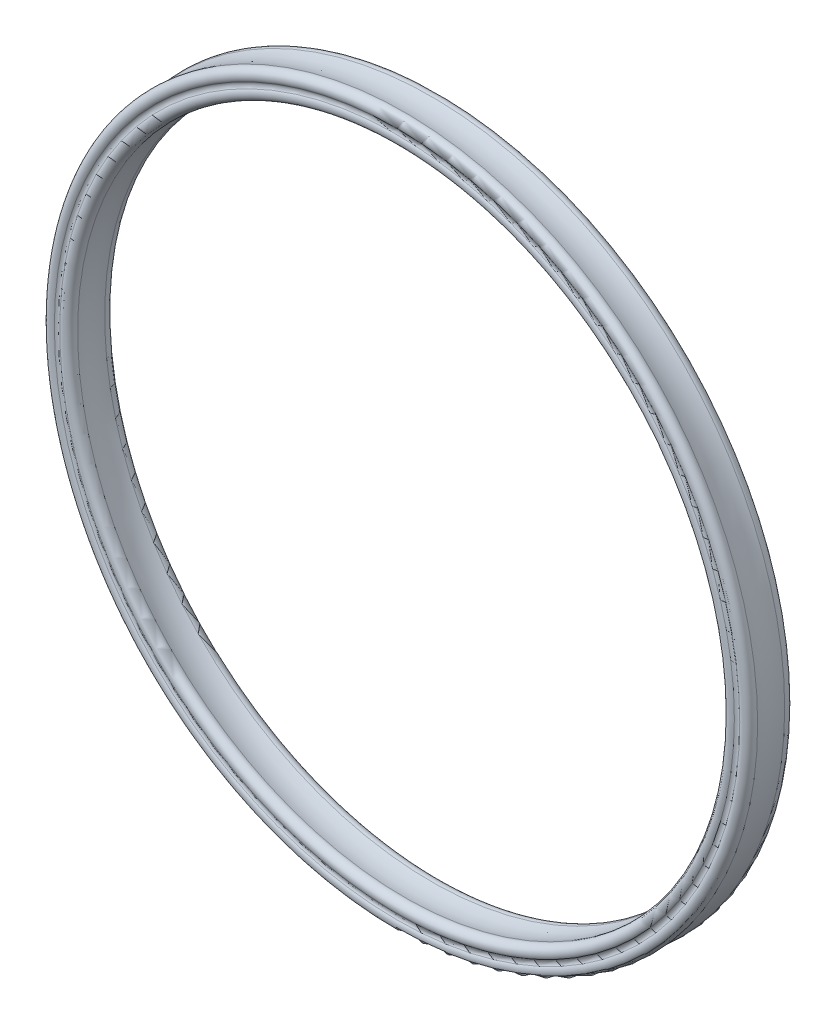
ISO-10303-21;
HEADER;
FILE_DESCRIPTION(('STEP AP214'),'2;1');
FILE_NAME('part.step','',(''),(''),'','','');
FILE_SCHEMA(('AUTOMOTIVE_DESIGN { 1 0 10303 214 1 1 1 1 }'));
ENDSEC;
DATA;
#1=APPLICATION_CONTEXT('core data for automotive mechanical design processes');
#2=APPLICATION_PROTOCOL_DEFINITION('international standard','automotive_design',2000,#1);
#3=PRODUCT_CONTEXT('',#1,'mechanical');
#4=PRODUCT('Part','Part','',(#3));
#5=PRODUCT_RELATED_PRODUCT_CATEGORY('part','',(#4));
#6=PRODUCT_DEFINITION_FORMATION('','',#4);
#7=PRODUCT_DEFINITION_CONTEXT('part definition',#1,'design');
#8=PRODUCT_DEFINITION('design','',#6,#7);
#9=PRODUCT_DEFINITION_SHAPE('','',#8);
#10=(LENGTH_UNIT() NAMED_UNIT(*) SI_UNIT(.MILLI.,.METRE.));
#11=(NAMED_UNIT(*) PLANE_ANGLE_UNIT() SI_UNIT($,.RADIAN.));
#12=(NAMED_UNIT(*) SI_UNIT($,.STERADIAN.) SOLID_ANGLE_UNIT());
#13=UNCERTAINTY_MEASURE_WITH_UNIT(LENGTH_MEASURE(1.E-05),#10,'distance_accuracy_value','');
#14=(GEOMETRIC_REPRESENTATION_CONTEXT(3) GLOBAL_UNCERTAINTY_ASSIGNED_CONTEXT((#13)) GLOBAL_UNIT_ASSIGNED_CONTEXT((#10,
#11,#12)) REPRESENTATION_CONTEXT('',''));
#15=CARTESIAN_POINT('',(0.,0.,0.));
#16=DIRECTION('',(0.,0.,1.));
#17=DIRECTION('',(1.,0.,0.));
#18=AXIS2_PLACEMENT_3D('',#15,#16,#17);
#19=CARTESIAN_POINT('',(0.,0.,0.241666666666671));
#20=DIRECTION('',(0.,0.,1.));
#21=DIRECTION('',(1.,0.,0.));
#22=AXIS2_PLACEMENT_3D('',#19,#20,#21);
#23=TOROIDAL_SURFACE('',#22,36.6,0.483333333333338);
#24=CARTESIAN_POINT('',(0.,0.,-0.14499999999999));
#25=DIRECTION('',(0.,0.,1.));
#26=DIRECTION('',(1.,0.,0.));
#27=AXIS2_PLACEMENT_3D('',#24,#25,#26);
#28=CIRCLE('',#27,36.31);
#29=CARTESIAN_POINT('',(36.31,0.,-0.14499999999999));
#30=VERTEX_POINT('',#29);
#31=EDGE_CURVE('E10',#30,#30,#28,.T.);
#32=ORIENTED_EDGE('',*,*,#31,.F.);
#33=EDGE_LOOP('',(#32));
#34=FACE_BOUND('',#33,.T.);
#35=CARTESIAN_POINT('',(0.,0.,-0.144999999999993));
#36=DIRECTION('',(0.,0.,1.));
#37=DIRECTION('',(1.,0.,0.));
#38=AXIS2_PLACEMENT_3D('',#35,#36,#37);
#39=CIRCLE('',#38,36.89);
#40=CARTESIAN_POINT('',(36.89,0.,-0.144999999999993));
#41=VERTEX_POINT('',#40);
#42=EDGE_CURVE('E59',#41,#41,#39,.T.);
#43=ORIENTED_EDGE('',*,*,#42,.T.);
#44=EDGE_LOOP('',(#43));
#45=FACE_BOUND('',#44,.T.);
#46=ADVANCED_FACE('F31',(#34,#45),#23,.F.);
#47=CARTESIAN_POINT('',(0.,0.,-0.724999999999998));
#48=DIRECTION('',(0.,0.,1.));
#49=DIRECTION('',(1.,0.,0.));
#50=AXIS2_PLACEMENT_3D('',#47,#48,#49);
#51=TOROIDAL_SURFACE('',#50,35.875,0.725000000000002);
#52=CARTESIAN_POINT('',(0.,0.,-0.944796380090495));
#53=DIRECTION('',(0.,0.,1.));
#54=DIRECTION('',(1.,0.,0.));
#55=AXIS2_PLACEMENT_3D('',#52,#53,#54);
#56=CIRCLE('',#55,35.1841204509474);
#57=CARTESIAN_POINT('',(35.1841204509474,0.,-0.944796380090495));
#58=VERTEX_POINT('',#57);
#59=EDGE_CURVE('E37',#58,#58,#56,.T.);
#60=ORIENTED_EDGE('',*,*,#59,.F.);
#61=EDGE_LOOP('',(#60));
#62=FACE_BOUND('',#61,.T.);
#63=ORIENTED_EDGE('',*,*,#31,.T.);
#64=EDGE_LOOP('',(#63));
#65=FACE_BOUND('',#64,.T.);
#66=ADVANCED_FACE('F96',(#62,#65),#51,.T.);
#67=CARTESIAN_POINT('',(0.,0.,-2.4));
#68=DIRECTION('',(0.,0.,1.));
#69=DIRECTION('',(1.,0.,0.));
#70=AXIS2_PLACEMENT_3D('',#67,#68,#69);
#71=TOROIDAL_SURFACE('',#70,30.6100213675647,4.79999999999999);
#72=CARTESIAN_POINT('',(0.,0.,-3.8552036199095));
#73=DIRECTION('',(0.,0.,1.));
#74=DIRECTION('',(1.,0.,0.));
#75=AXIS2_PLACEMENT_3D('',#72,#73,#74);
#76=CIRCLE('',#75,35.1841204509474);
#77=CARTESIAN_POINT('',(35.1841204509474,0.,-3.8552036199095));
#78=VERTEX_POINT('',#77);
#79=EDGE_CURVE('E41',#78,#78,#76,.T.);
#80=ORIENTED_EDGE('',*,*,#79,.F.);
#81=EDGE_LOOP('',(#80));
#82=FACE_BOUND('',#81,.T.);
#83=ORIENTED_EDGE('',*,*,#59,.T.);
#84=EDGE_LOOP('',(#83));
#85=FACE_BOUND('',#84,.T.);
#86=ADVANCED_FACE('F91',(#82,#85),#71,.F.);
#87=CARTESIAN_POINT('',(0.,0.,-4.075));
#88=DIRECTION('',(0.,0.,1.));
#89=DIRECTION('',(1.,0.,0.));
#90=AXIS2_PLACEMENT_3D('',#87,#88,#89);
#91=TOROIDAL_SURFACE('',#90,35.875,0.725000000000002);
#92=CARTESIAN_POINT('',(0.,0.,-4.65500000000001));
#93=DIRECTION('',(0.,0.,1.));
#94=DIRECTION('',(1.,0.,0.));
#95=AXIS2_PLACEMENT_3D('',#92,#93,#94);
#96=CIRCLE('',#95,36.31);
#97=CARTESIAN_POINT('',(36.31,0.,-4.65500000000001));
#98=VERTEX_POINT('',#97);
#99=EDGE_CURVE('E45',#98,#98,#96,.T.);
#100=ORIENTED_EDGE('',*,*,#99,.F.);
#101=EDGE_LOOP('',(#100));
#102=FACE_BOUND('',#101,.T.);
#103=ORIENTED_EDGE('',*,*,#79,.T.);
#104=EDGE_LOOP('',(#103));
#105=FACE_BOUND('',#104,.T.);
#106=ADVANCED_FACE('F85',(#102,#105),#91,.T.);
#107=CARTESIAN_POINT('',(0.,0.,-5.04166666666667));
#108=DIRECTION('',(0.,0.,1.));
#109=DIRECTION('',(1.,0.,0.));
#110=AXIS2_PLACEMENT_3D('',#107,#108,#109);
#111=TOROIDAL_SURFACE('',#110,36.6,0.483333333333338);
#112=CARTESIAN_POINT('',(0.,0.,-4.655));
#113=DIRECTION('',(0.,0.,1.));
#114=DIRECTION('',(1.,0.,0.));
#115=AXIS2_PLACEMENT_3D('',#112,#113,#114);
#116=CIRCLE('',#115,36.89);
#117=CARTESIAN_POINT('',(36.89,0.,-4.655));
#118=VERTEX_POINT('',#117);
#119=EDGE_CURVE('E50',#118,#118,#116,.T.);
#120=ORIENTED_EDGE('',*,*,#119,.F.);
#121=EDGE_LOOP('',(#120));
#122=FACE_BOUND('',#121,.T.);
#123=ORIENTED_EDGE('',*,*,#99,.T.);
#124=EDGE_LOOP('',(#123));
#125=FACE_BOUND('',#124,.T.);
#126=ADVANCED_FACE('F79',(#122,#125),#111,.F.);
#127=CARTESIAN_POINT('',(0.,0.,-4.075));
#128=DIRECTION('',(0.,0.,1.));
#129=DIRECTION('',(1.,0.,0.));
#130=AXIS2_PLACEMENT_3D('',#127,#128,#129);
#131=TOROIDAL_SURFACE('',#130,37.325,0.725000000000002);
#132=CARTESIAN_POINT('',(0.,0.,-3.8552036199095));
#133=DIRECTION('',(0.,0.,1.));
#134=DIRECTION('',(1.,0.,0.));
#135=AXIS2_PLACEMENT_3D('',#132,#133,#134);
#136=CIRCLE('',#135,38.0158795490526);
#137=CARTESIAN_POINT('',(38.0158795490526,0.,-3.8552036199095));
#138=VERTEX_POINT('',#137);
#139=EDGE_CURVE('E53',#138,#138,#136,.T.);
#140=ORIENTED_EDGE('',*,*,#139,.F.);
#141=EDGE_LOOP('',(#140));
#142=FACE_BOUND('',#141,.T.);
#143=ORIENTED_EDGE('',*,*,#119,.T.);
#144=EDGE_LOOP('',(#143));
#145=FACE_BOUND('',#144,.T.);
#146=ADVANCED_FACE('F73',(#142,#145),#131,.T.);
#147=CARTESIAN_POINT('',(0.,0.,-2.4));
#148=DIRECTION('',(0.,0.,1.));
#149=DIRECTION('',(1.,0.,0.));
#150=AXIS2_PLACEMENT_3D('',#147,#148,#149);
#151=TOROIDAL_SURFACE('',#150,42.5899786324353,4.79999999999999);
#152=CARTESIAN_POINT('',(0.,0.,-0.944796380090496));
#153=DIRECTION('',(0.,0.,1.));
#154=DIRECTION('',(1.,0.,0.));
#155=AXIS2_PLACEMENT_3D('',#152,#153,#154);
#156=CIRCLE('',#155,38.0158795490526);
#157=CARTESIAN_POINT('',(38.0158795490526,0.,-0.944796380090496));
#158=VERTEX_POINT('',#157);
#159=EDGE_CURVE('E56',#158,#158,#156,.T.);
#160=ORIENTED_EDGE('',*,*,#159,.F.);
#161=EDGE_LOOP('',(#160));
#162=FACE_BOUND('',#161,.T.);
#163=ORIENTED_EDGE('',*,*,#139,.T.);
#164=EDGE_LOOP('',(#163));
#165=FACE_BOUND('',#164,.T.);
#166=ADVANCED_FACE('F67',(#162,#165),#151,.F.);
#167=CARTESIAN_POINT('',(0.,0.,-0.724999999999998));
#168=DIRECTION('',(0.,0.,1.));
#169=DIRECTION('',(1.,0.,0.));
#170=AXIS2_PLACEMENT_3D('',#167,#168,#169);
#171=TOROIDAL_SURFACE('',#170,37.325,0.725000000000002);
#172=ORIENTED_EDGE('',*,*,#42,.F.);
#173=EDGE_LOOP('',(#172));
#174=FACE_BOUND('',#173,.T.);
#175=ORIENTED_EDGE('',*,*,#159,.T.);
#176=EDGE_LOOP('',(#175));
#177=FACE_BOUND('',#176,.T.);
#178=ADVANCED_FACE('F64',(#174,#177),#171,.T.);
#179=CLOSED_SHELL('',(#46,#66,#86,#106,#126,#146,#166,#178));
#180=MANIFOLD_SOLID_BREP('B2',#179);
#181=ADVANCED_BREP_SHAPE_REPRESENTATION('',(#18,#180),#14);
#182=SHAPE_DEFINITION_REPRESENTATION(#9,#181);
ENDSEC;
END-ISO-10303-21;
